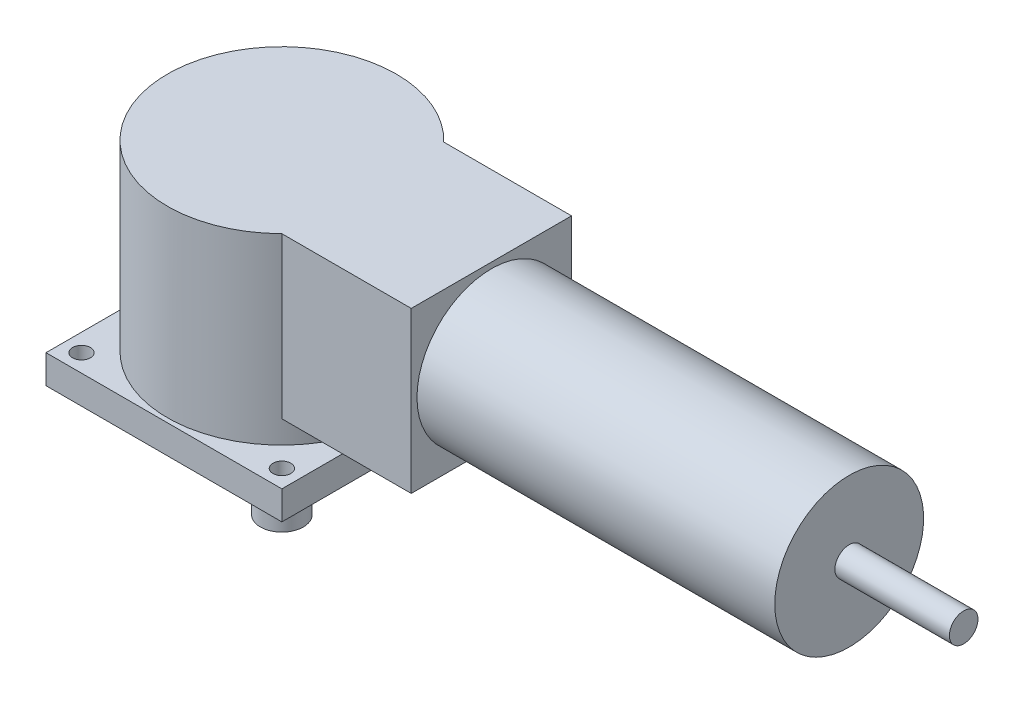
from build123d import *

# Parameters (mm, degrees)
SKETCH1_W                  = 52.324
SKETCH1_H                  = 52.324
EXTRUDE1_DEPTH             = 6.35
LPATTERN2_COUNT            = 2
LPATTERN2_PITCH            = 44.45
LPATTERN2_COUNT_DIR2       = 2
LPATTERN2_PITCH_DIR2       = 44.45
SKETCH3_R                  = 25.4
EXTRUDE2_DEPTH             = 40.64
SKETCH5_W                  = 35.56
SKETCH5_H                  = 35.56
EXTRUDE3_DEPTH             = 20.32
EXTRUDE3_DIRECTION_2_REACH = 89.657
SKETCH6_R                  = 16.51
EXTRUDE4_DEPTH             = 79.375
SKETCH7_R                  = 3.175
EXTRUDE5_DEPTH             = 25.4
SKETCH8_R                  = 15.875
EXTRUDE6_DEPTH             = 2.794
SKETCH9_R                  = 4.7625
EXTRUDE7_DEPTH             = 21.971


with BuildPart() as part:
    # Sketch1 → Extrude1 (new body)
    with BuildSketch(Plane(origin=(0, 0, 0), x_dir=(1, 0, 0), z_dir=(0, 1, 0))):
        with Locations((-26.162, -26.162)):
            Rectangle(SKETCH1_W, SKETCH1_H)
    extrude(amount=EXTRUDE1_DEPTH)

    # Sketch2 → 5_32 _0.15625_ Diameter Hole1 (revolve, cut)
    with BuildSketch(Plane(origin=(-48.387, 6.35, 3.937), x_dir=(0, 0, 1), z_dir=(1, 0, 0))):
        Polygon((0, 0), (0, 10.336332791), (1.984375, 9.144), (1.984375, 0), align=None)
    f_5_32_0_15625_diameter_hole1 = revolve(axis=Axis((-48.387, 12.7, 3.937), (0, -1, 0)), mode=Mode.SUBTRACT)

    # LPattern2: 5_32 _0.15625_ Diameter Hole1 2 × 2
    with Locations(*[(i * LPATTERN2_PITCH, 0, j * LPATTERN2_PITCH_DIR2) for i in range(LPATTERN2_COUNT) for j in range(LPATTERN2_COUNT_DIR2) if (i, j) != (0, 0)]):
        add(f_5_32_0_15625_diameter_hole1, mode=Mode.SUBTRACT)

    # Sketch3 → Extrude2 (add)
    with BuildSketch(Plane(origin=(0, 6.35, 0), x_dir=(-1, 0, 0), z_dir=(0, 1, 0))):
        with Locations(Location((26.3525, 25.9715, 0), (0, 0, 270))):
            Circle(SKETCH3_R)
    extrude(amount=EXTRUDE2_DEPTH)

    # Sketch5 → Extrude3 (add)
    with BuildSketch(Plane(origin=(0, 0, 0), x_dir=(0, 0, -1), z_dir=(1, 0, 0))):
        with Locations((-26.162, 29.21)):
            Rectangle(SKETCH5_W, SKETCH5_H)
    extrude(amount=EXTRUDE3_DEPTH)

    # Sketch5 → Extrude3 direction 2 (add, up to next)
    with BuildSketch(Plane(origin=(0, 0, 0), x_dir=(0, 0, -1), z_dir=(1, 0, 0)), mode=Mode.PRIVATE) as extrude3_direction_2_sk1:
        with Locations((-26.162, 29.21)):
            Rectangle(SKETCH5_W, SKETCH5_H)
    extrude3_direction_2_tool1 = extrude(extrude3_direction_2_sk1.sketch, amount=-EXTRUDE3_DIRECTION_2_REACH, mode=Mode.PRIVATE) - part.part
    add(extrude3_direction_2_tool1.solids().sort_by_distance((0, 29.21, 26.162))[0])

    # Sketch6 → Extrude4 (add)
    with BuildSketch(Plane(origin=(20.32, 0, 0), x_dir=(0, 0, -1), z_dir=(1, 0, 0))):
        with Locations(Location((-26.162, 29.21, 0), (0, 0, 180))):
            Circle(SKETCH6_R)
    extrude(amount=EXTRUDE4_DEPTH)

    # Sketch7 → Extrude5 (add)
    with BuildSketch(Plane(origin=(99.695, 0, 0), x_dir=(0, 0, -1), z_dir=(1, 0, 0))):
        with Locations((-26.162, 29.21)):
            Circle(SKETCH7_R)
    extrude(amount=EXTRUDE5_DEPTH)

    # Sketch8 → Extrude6 (add)
    with BuildSketch(Plane.XZ):
        with Locations(Location((-26.162, 26.162, 0), (0, 0, 270))):
            Circle(SKETCH8_R)
    extrude(amount=EXTRUDE6_DEPTH)

    # Sketch9 → Extrude7 (add)
    with BuildSketch(Plane.XZ.offset(2.794)):
        with Locations(Location((-26.162, 26.162, 0), (0, 0, 90))):
            Circle(SKETCH9_R)
    extrude(amount=EXTRUDE7_DEPTH)


solid = part.part
